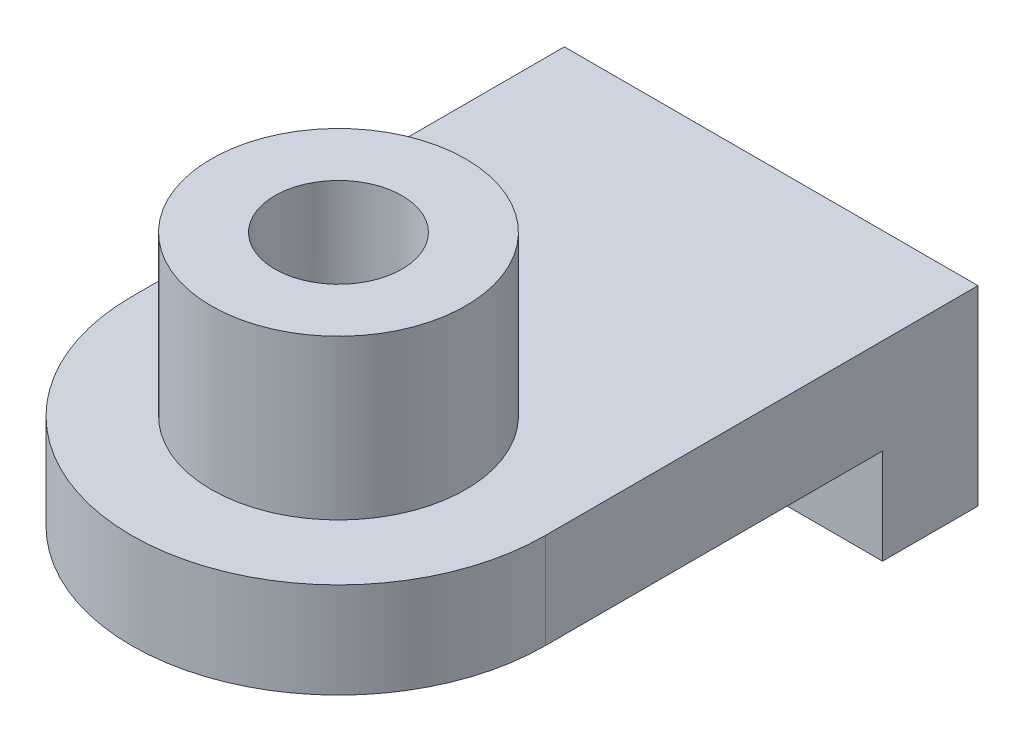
from build123d import *

# Parameters (mm, degrees)
BASE_EXTRUDE_DEPTH  = 15
SKETCH2_W           = 15
SKETCH2_H           = 15
BOSS_EXTRUDE1_DEPTH = 65
SKETCH3_R           = 20
BOSS_EXTRUDE2_DEPTH = 25
HOLE1_D             = 20
HOLE1_DEPTH         = 25


with BuildPart() as part:
    # Sketch1 → Base-Extrude (new body)
    with BuildSketch(Plane(origin=(0, 0, 0), x_dir=(1, 0, 0), z_dir=(0, 1, 0))):
        with BuildLine():
            Line((32.5, 0), (32.5, 68))
            Line((32.5, 68), (-32.5, 68))
            Line((-32.5, 68), (-32.5, 0))
            ThreePointArc((-32.5, 0), (0, -32.5), (32.5, 0))
        make_face()
    extrude(amount=BASE_EXTRUDE_DEPTH)

    # Sketch2 → Boss-Extrude1 (add, through all)
    with BuildSketch(Plane(origin=(32.5, 0, 0), x_dir=(0, 0, -1), z_dir=(1, 0, 0))):
        with Locations((60.5, -7.5)):
            Rectangle(SKETCH2_W, SKETCH2_H)
    extrude(amount=-BOSS_EXTRUDE1_DEPTH)

    # Sketch3 → Boss-Extrude2 (add)
    with BuildSketch(Plane(origin=(0, 15, 0), x_dir=(-1, 0, 0), z_dir=(0, 1, 0))):
        with Locations(Location((0, 0, 0), (0, 0, 270))):
            Circle(SKETCH3_R)
    extrude(amount=BOSS_EXTRUDE2_DEPTH)

    # Hole1
    with Locations(Plane(origin=(0, 40, 0), x_dir=(-1, 0, 0), z_dir=(0, 1, 0))):
        with Locations((0, 0)):
            Hole(HOLE1_D / 2, depth=HOLE1_DEPTH)


solid = part.part
